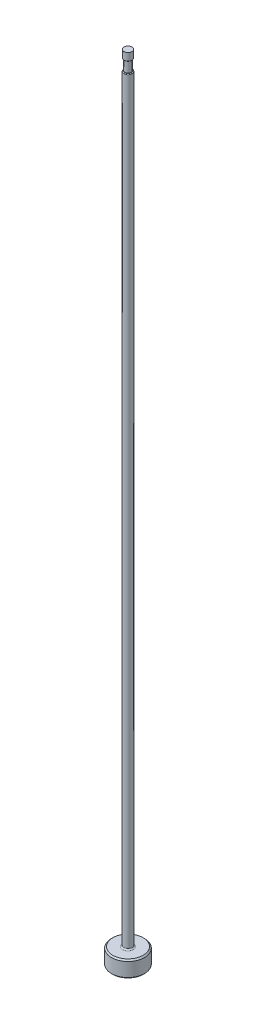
from build123d import *

# Parameters (mm, degrees)
CHAMFER1_SIZE     = 0.254
FILLET1_R         = 0.254
SKETCH2_W         = 0.2032
SKETCH2_H         = 2.032
D_SLOT_DEPTH      = 153.466131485
D_SLOT_DEPTH_BACK = 153.466131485
SKETCH5_W         = 0.0254
SKETCH5_H         = 1.524
FILLET2_R         = 0.127


with BuildPart() as part:
    # Sketch1 → Revolve1 (revolve)
    with BuildSketch(Plane.XY, mode=Mode.PRIVATE) as revolve1_sk:
        Polygon((0, 0), (-3.175, 0), (-3.175, 3.175), (-0.79375, 3.175), (-0.79375, 152.4), (0, 152.4), align=None)
    revolve(revolve1_sk.sketch.rotate(Axis((0, 259.958771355, 0), (0, -1, 0)), 270), axis=Axis((0, 259.958771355, 0), (0, -1, 0)))

    # Chamfer1
    chamfer1_edges = [part.edges().sort_by_distance(p)[0] for p in [
        (0, 3.175, -3.175),
        (0, 0, -3.175),
    ]]
    chamfer(chamfer1_edges, length=CHAMFER1_SIZE)

    # Fillet1
    fillet1_edges = [part.edges().sort_by_distance(p)[0] for p in [
        (0, 3.175, -0.79375),
    ]]
    fillet(fillet1_edges, radius=FILLET1_R)

    # Sketch2 → Vent Relief (revolve, cut)
    with BuildSketch(Plane.XY, mode=Mode.PRIVATE) as vent_relief_sk:
        with Locations((-0.69215, 149.86)):
            Rectangle(SKETCH2_W, SKETCH2_H)
    revolve(vent_relief_sk.sketch.rotate(Axis((0, 153.448281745, 0), (0, -1, 0)), 270), axis=Axis((0, 153.448281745, 0), (0, -1, 0)), mode=Mode.SUBTRACT)

    # Sketch3 → D-Slot (cut, two sides: drawn at the far end of the back side and taken through both)
    with BuildSketch(Plane.XY.offset(-D_SLOT_DEPTH_BACK)):
        with BuildLine():
            Line((-0.59055, 149.86), (-0.59055, 86.36))
            ThreePointArc((-0.59055, 86.36), (-0.641763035, 85.792038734), (-0.79375, 85.2424))
            Line((-0.79375, 85.2424), (-0.79375, 149.86))
            Line((-0.79375, 149.86), (-0.59055, 149.86))
        make_face()
    extrude(amount=D_SLOT_DEPTH + D_SLOT_DEPTH_BACK, mode=Mode.SUBTRACT)

    # Sketch5 → Vent Diameter (revolve, cut)
    with BuildSketch(Plane.XY, mode=Mode.PRIVATE) as vent_diameter_sk:
        with Locations((-0.78105, 151.638)):
            Rectangle(SKETCH5_W, SKETCH5_H)
    revolve(vent_diameter_sk.sketch.rotate(Axis((0, 152.687735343, 0), (0, -1, 0)), 90), axis=Axis((0, 152.687735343, 0), (0, -1, 0)), mode=Mode.SUBTRACT)

    # Fillet2
    fillet2_edges = [part.edges().sort_by_distance(p)[0] for p in [
        (0.724920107, 148.844, -0.323310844),
        (0, 150.876, 0.76835),
    ]]
    fillet(fillet2_edges, radius=FILLET2_R)


solid = part.part
